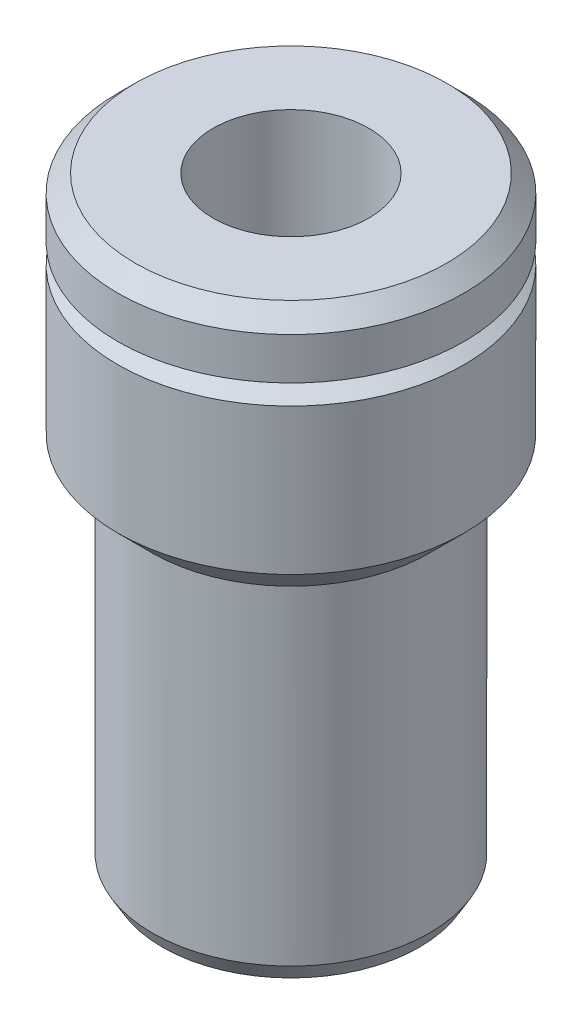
ISO-10303-21;
HEADER;
FILE_DESCRIPTION(('STEP AP214'),'2;1');
FILE_NAME('part.step','',(''),(''),'','','');
FILE_SCHEMA(('AUTOMOTIVE_DESIGN { 1 0 10303 214 1 1 1 1 }'));
ENDSEC;
DATA;
#1=APPLICATION_CONTEXT('core data for automotive mechanical design processes');
#2=APPLICATION_PROTOCOL_DEFINITION('international standard','automotive_design',2000,#1);
#3=PRODUCT_CONTEXT('',#1,'mechanical');
#4=PRODUCT('Part','Part','',(#3));
#5=PRODUCT_RELATED_PRODUCT_CATEGORY('part','',(#4));
#6=PRODUCT_DEFINITION_FORMATION('','',#4);
#7=PRODUCT_DEFINITION_CONTEXT('part definition',#1,'design');
#8=PRODUCT_DEFINITION('design','',#6,#7);
#9=PRODUCT_DEFINITION_SHAPE('','',#8);
#10=(LENGTH_UNIT() NAMED_UNIT(*) SI_UNIT(.MILLI.,.METRE.));
#11=(NAMED_UNIT(*) PLANE_ANGLE_UNIT() SI_UNIT($,.RADIAN.));
#12=(NAMED_UNIT(*) SI_UNIT($,.STERADIAN.) SOLID_ANGLE_UNIT());
#13=UNCERTAINTY_MEASURE_WITH_UNIT(LENGTH_MEASURE(1.E-05),#10,'distance_accuracy_value','');
#14=(GEOMETRIC_REPRESENTATION_CONTEXT(3) GLOBAL_UNCERTAINTY_ASSIGNED_CONTEXT((#13)) GLOBAL_UNIT_ASSIGNED_CONTEXT((#10,
#11,#12)) REPRESENTATION_CONTEXT('',''));
#15=CARTESIAN_POINT('',(0.,0.,0.));
#16=DIRECTION('',(0.,0.,1.));
#17=DIRECTION('',(1.,0.,0.));
#18=AXIS2_PLACEMENT_3D('',#15,#16,#17);
#19=CARTESIAN_POINT('',(0.,25.7125,0.));
#20=DIRECTION('',(0.,1.,0.));
#21=DIRECTION('',(0.,0.,1.));
#22=AXIS2_PLACEMENT_3D('',#19,#20,#21);
#23=CYLINDRICAL_SURFACE('',#22,4.49999999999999);
#24=CARTESIAN_POINT('',(0.,15.,0.));
#25=DIRECTION('',(0.,1.,0.));
#26=DIRECTION('',(0.,0.,1.));
#27=AXIS2_PLACEMENT_3D('',#24,#25,#26);
#28=CIRCLE('',#27,4.49999999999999);
#29=CARTESIAN_POINT('',(0.,15.,4.49999999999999));
#30=VERTEX_POINT('',#29);
#31=EDGE_CURVE('E63',#30,#30,#28,.T.);
#32=ORIENTED_EDGE('',*,*,#31,.T.);
#33=EDGE_LOOP('',(#32));
#34=FACE_BOUND('',#33,.T.);
#35=CARTESIAN_POINT('',(0.,-20.,0.));
#36=DIRECTION('',(0.,1.,0.));
#37=DIRECTION('',(0.,0.,1.));
#38=AXIS2_PLACEMENT_3D('',#35,#36,#37);
#39=CIRCLE('',#38,4.49999999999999);
#40=CARTESIAN_POINT('',(0.,-20.,4.49999999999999));
#41=VERTEX_POINT('',#40);
#42=EDGE_CURVE('E48',#41,#41,#39,.T.);
#43=ORIENTED_EDGE('',*,*,#42,.F.);
#44=EDGE_LOOP('',(#43));
#45=FACE_BOUND('',#44,.T.);
#46=ADVANCED_FACE('F26',(#34,#45),#23,.F.);
#47=CARTESIAN_POINT('',(7.99999999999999,-20.,0.));
#48=DIRECTION('',(0.,-1.,0.));
#49=DIRECTION('',(0.,0.,-1.));
#50=AXIS2_PLACEMENT_3D('',#47,#48,#49);
#51=PLANE('',#50);
#52=CARTESIAN_POINT('',(0.,-20.,0.));
#53=DIRECTION('',(0.,-1.,0.));
#54=DIRECTION('',(0.,0.,-1.));
#55=AXIS2_PLACEMENT_3D('',#52,#53,#54);
#56=CIRCLE('',#55,7.42264973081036);
#57=CARTESIAN_POINT('',(0.,-20.,-7.42264973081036));
#58=VERTEX_POINT('',#57);
#59=EDGE_CURVE('E32',#58,#58,#56,.T.);
#60=ORIENTED_EDGE('',*,*,#59,.T.);
#61=EDGE_LOOP('',(#60));
#62=FACE_BOUND('',#61,.T.);
#63=ORIENTED_EDGE('',*,*,#42,.T.);
#64=EDGE_LOOP('',(#63));
#65=FACE_BOUND('',#64,.T.);
#66=ADVANCED_FACE('F86',(#62,#65),#51,.T.);
#67=CARTESIAN_POINT('',(0.,25.7125,0.));
#68=DIRECTION('',(0.,1.,0.));
#69=DIRECTION('',(0.,0.,1.));
#70=AXIS2_PLACEMENT_3D('',#67,#68,#69);
#71=CYLINDRICAL_SURFACE('',#70,8.);
#72=CARTESIAN_POINT('',(0.,-19.,0.));
#73=DIRECTION('',(0.,-1.,0.));
#74=DIRECTION('',(0.,0.,-1.));
#75=AXIS2_PLACEMENT_3D('',#72,#73,#74);
#76=CIRCLE('',#75,8.);
#77=CARTESIAN_POINT('',(0.,-19.,-8.));
#78=VERTEX_POINT('',#77);
#79=EDGE_CURVE('E36',#78,#78,#76,.F.);
#80=ORIENTED_EDGE('',*,*,#79,.T.);
#81=EDGE_LOOP('',(#80));
#82=FACE_BOUND('',#81,.T.);
#83=CARTESIAN_POINT('',(0.,0.,0.));
#84=DIRECTION('',(0.,1.,0.));
#85=DIRECTION('',(0.,0.,1.));
#86=AXIS2_PLACEMENT_3D('',#83,#84,#85);
#87=CIRCLE('',#86,8.);
#88=CARTESIAN_POINT('',(0.,0.,8.));
#89=VERTEX_POINT('',#88);
#90=EDGE_CURVE('E51',#89,#89,#87,.T.);
#91=ORIENTED_EDGE('',*,*,#90,.F.);
#92=EDGE_LOOP('',(#91));
#93=FACE_BOUND('',#92,.T.);
#94=ADVANCED_FACE('F90',(#82,#93),#71,.T.);
#95=CARTESIAN_POINT('',(0.,25.7125,0.));
#96=DIRECTION('',(0.,1.,0.));
#97=DIRECTION('',(0.,0.,1.));
#98=AXIS2_PLACEMENT_3D('',#95,#96,#97);
#99=CYLINDRICAL_SURFACE('',#98,10.);
#100=CARTESIAN_POINT('',(0.,2.00000000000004,0.));
#101=DIRECTION('',(0.,-1.,0.));
#102=DIRECTION('',(0.,0.,-1.));
#103=AXIS2_PLACEMENT_3D('',#100,#101,#102);
#104=CIRCLE('',#103,10.);
#105=CARTESIAN_POINT('',(0.,2.00000000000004,-10.));
#106=VERTEX_POINT('',#105);
#107=EDGE_CURVE('E10',#106,#106,#104,.F.);
#108=ORIENTED_EDGE('',*,*,#107,.T.);
#109=EDGE_LOOP('',(#108));
#110=FACE_BOUND('',#109,.T.);
#111=CARTESIAN_POINT('',(0.,10.4226497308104,0.));
#112=DIRECTION('',(0.,1.,0.));
#113=DIRECTION('',(0.,0.,1.));
#114=AXIS2_PLACEMENT_3D('',#111,#112,#113);
#115=CIRCLE('',#114,10.);
#116=CARTESIAN_POINT('',(0.,10.4226497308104,10.));
#117=VERTEX_POINT('',#116);
#118=EDGE_CURVE('E54',#117,#117,#115,.T.);
#119=ORIENTED_EDGE('',*,*,#118,.F.);
#120=EDGE_LOOP('',(#119));
#121=FACE_BOUND('',#120,.T.);
#122=ADVANCED_FACE('F94',(#110,#121),#99,.T.);
#123=CARTESIAN_POINT('',(0.,11.,0.));
#124=DIRECTION('',(0.,-1.,0.));
#125=DIRECTION('',(0.,0.,-1.));
#126=AXIS2_PLACEMENT_3D('',#123,#124,#125);
#127=CONICAL_SURFACE('',#126,9.,1.0471975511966);
#128=ORIENTED_EDGE('',*,*,#118,.T.);
#129=EDGE_LOOP('',(#128));
#130=FACE_BOUND('',#129,.T.);
#131=CARTESIAN_POINT('',(0.,11.,0.));
#132=DIRECTION('',(0.,1.,0.));
#133=DIRECTION('',(0.,0.,1.));
#134=AXIS2_PLACEMENT_3D('',#131,#132,#133);
#135=CIRCLE('',#134,9.);
#136=CARTESIAN_POINT('',(0.,11.,9.));
#137=VERTEX_POINT('',#136);
#138=EDGE_CURVE('E57',#137,#137,#135,.T.);
#139=ORIENTED_EDGE('',*,*,#138,.F.);
#140=EDGE_LOOP('',(#139));
#141=FACE_BOUND('',#140,.T.);
#142=ADVANCED_FACE('F101',(#130,#141),#127,.T.);
#143=CARTESIAN_POINT('',(0.,11.5773502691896,0.));
#144=DIRECTION('',(0.,1.,0.));
#145=DIRECTION('',(0.,0.,1.));
#146=AXIS2_PLACEMENT_3D('',#143,#144,#145);
#147=CONICAL_SURFACE('',#146,10.,1.0471975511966);
#148=ORIENTED_EDGE('',*,*,#138,.T.);
#149=EDGE_LOOP('',(#148));
#150=FACE_BOUND('',#149,.T.);
#151=CARTESIAN_POINT('',(0.,11.5773502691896,0.));
#152=DIRECTION('',(0.,1.,0.));
#153=DIRECTION('',(0.,0.,1.));
#154=AXIS2_PLACEMENT_3D('',#151,#152,#153);
#155=CIRCLE('',#154,10.);
#156=CARTESIAN_POINT('',(0.,11.5773502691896,10.));
#157=VERTEX_POINT('',#156);
#158=EDGE_CURVE('E60',#157,#157,#155,.T.);
#159=ORIENTED_EDGE('',*,*,#158,.F.);
#160=EDGE_LOOP('',(#159));
#161=FACE_BOUND('',#160,.T.);
#162=ADVANCED_FACE('F82',(#150,#161),#147,.T.);
#163=CARTESIAN_POINT('',(0.,25.7125,0.));
#164=DIRECTION('',(0.,1.,0.));
#165=DIRECTION('',(0.,0.,1.));
#166=AXIS2_PLACEMENT_3D('',#163,#164,#165);
#167=CYLINDRICAL_SURFACE('',#166,10.);
#168=CARTESIAN_POINT('',(0.,14.,0.));
#169=DIRECTION('',(0.,1.,0.));
#170=DIRECTION('',(0.,0.,1.));
#171=AXIS2_PLACEMENT_3D('',#168,#169,#170);
#172=CIRCLE('',#171,10.);
#173=CARTESIAN_POINT('',(0.,14.,10.));
#174=VERTEX_POINT('',#173);
#175=EDGE_CURVE('E40',#174,#174,#172,.F.);
#176=ORIENTED_EDGE('',*,*,#175,.T.);
#177=EDGE_LOOP('',(#176));
#178=FACE_BOUND('',#177,.T.);
#179=ORIENTED_EDGE('',*,*,#158,.T.);
#180=EDGE_LOOP('',(#179));
#181=FACE_BOUND('',#180,.T.);
#182=ADVANCED_FACE('F72',(#178,#181),#167,.T.);
#183=CARTESIAN_POINT('',(4.49999999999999,15.,0.));
#184=DIRECTION('',(0.,1.,0.));
#185=DIRECTION('',(0.,0.,1.));
#186=AXIS2_PLACEMENT_3D('',#183,#184,#185);
#187=PLANE('',#186);
#188=CARTESIAN_POINT('',(0.,15.,0.));
#189=DIRECTION('',(0.,1.,0.));
#190=DIRECTION('',(0.,0.,1.));
#191=AXIS2_PLACEMENT_3D('',#188,#189,#190);
#192=CIRCLE('',#191,8.99999999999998);
#193=CARTESIAN_POINT('',(0.,15.,8.99999999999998));
#194=VERTEX_POINT('',#193);
#195=EDGE_CURVE('E45',#194,#194,#192,.T.);
#196=ORIENTED_EDGE('',*,*,#195,.T.);
#197=EDGE_LOOP('',(#196));
#198=FACE_BOUND('',#197,.T.);
#199=ORIENTED_EDGE('',*,*,#31,.F.);
#200=EDGE_LOOP('',(#199));
#201=FACE_BOUND('',#200,.T.);
#202=ADVANCED_FACE('F69',(#198,#201),#187,.T.);
#203=CARTESIAN_POINT('',(0.,15.,0.));
#204=DIRECTION('',(0.,-1.,0.));
#205=DIRECTION('',(0.,0.,-1.));
#206=AXIS2_PLACEMENT_3D('',#203,#204,#205);
#207=CONICAL_SURFACE('',#206,8.99999999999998,0.785398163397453);
#208=ORIENTED_EDGE('',*,*,#175,.F.);
#209=EDGE_LOOP('',(#208));
#210=FACE_BOUND('',#209,.T.);
#211=ORIENTED_EDGE('',*,*,#195,.F.);
#212=EDGE_LOOP('',(#211));
#213=FACE_BOUND('',#212,.T.);
#214=ADVANCED_FACE('F71',(#210,#213),#207,.T.);
#215=CARTESIAN_POINT('',(0.,-19.,0.));
#216=DIRECTION('',(0.,1.,0.));
#217=DIRECTION('',(0.,0.,1.));
#218=AXIS2_PLACEMENT_3D('',#215,#216,#217);
#219=CONICAL_SURFACE('',#218,8.,0.523598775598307);
#220=ORIENTED_EDGE('',*,*,#59,.F.);
#221=EDGE_LOOP('',(#220));
#222=FACE_BOUND('',#221,.T.);
#223=ORIENTED_EDGE('',*,*,#79,.F.);
#224=EDGE_LOOP('',(#223));
#225=FACE_BOUND('',#224,.T.);
#226=ADVANCED_FACE('F79',(#222,#225),#219,.T.);
#227=CARTESIAN_POINT('',(0.,2.00000000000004,0.));
#228=DIRECTION('',(0.,1.,0.));
#229=DIRECTION('',(0.,0.,1.));
#230=AXIS2_PLACEMENT_3D('',#227,#228,#229);
#231=CONICAL_SURFACE('',#230,10.,0.785398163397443);
#232=ORIENTED_EDGE('',*,*,#90,.T.);
#233=EDGE_LOOP('',(#232));
#234=FACE_BOUND('',#233,.T.);
#235=ORIENTED_EDGE('',*,*,#107,.F.);
#236=EDGE_LOOP('',(#235));
#237=FACE_BOUND('',#236,.T.);
#238=ADVANCED_FACE('F133',(#234,#237),#231,.T.);
#239=CLOSED_SHELL('',(#46,#66,#94,#122,#142,#162,#182,#202,#214,#226,#238));
#240=MANIFOLD_SOLID_BREP('B2',#239);
#241=ADVANCED_BREP_SHAPE_REPRESENTATION('',(#18,#240),#14);
#242=SHAPE_DEFINITION_REPRESENTATION(#9,#241);
ENDSEC;
END-ISO-10303-21;
